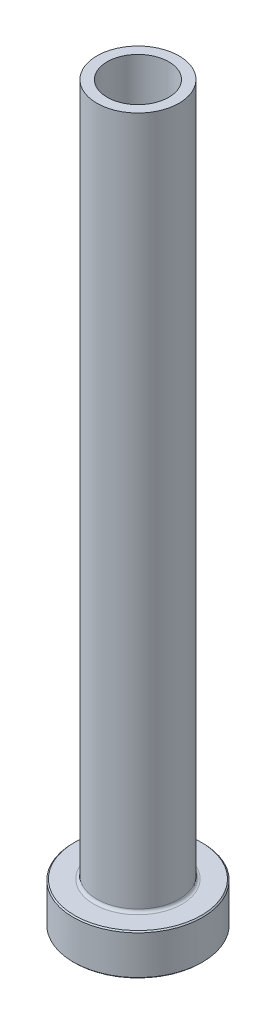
from build123d import *

# Parameters (mm, degrees)
FILLET1_R     = 0.5
CHAMFER1_SIZE = 0.2
CHAMFER3_SIZE = 0.5


with BuildPart() as part:
    # Sketch1 → Revolve1 (revolve)
    with BuildSketch(Plane.XY, mode=Mode.PRIVATE) as revolve1_sk:
        Polygon((-5.25, 125), (-7, 125), (-7, 7), (-11, 7), (-11, 0), (-5.5, 0), (-5.5, 58), (-5.25, 70), align=None)
    revolve(revolve1_sk.sketch.rotate(Axis((0, 92.187680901, 0), (0, -1, 0)), 270), axis=Axis((0, 92.187680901, 0), (0, -1, 0)))

    # Fillet1
    fillet1_edges = [part.edges().sort_by_distance(p)[0] for p in [
        (0, 7, -7),
    ]]
    fillet(fillet1_edges, radius=FILLET1_R)

    # Chamfer1
    chamfer1_edges = [part.edges().sort_by_distance(p)[0] for p in [
        (0, 0, -11),
        (0, 7, -11),
    ]]
    chamfer(chamfer1_edges, length=CHAMFER1_SIZE)

    # Chamfer3
    chamfer3_edges = [part.edges().sort_by_distance(p)[0] for p in [
        (0, 0, -5.5),
    ]]
    chamfer(chamfer3_edges, length=CHAMFER3_SIZE)


solid = part.part
